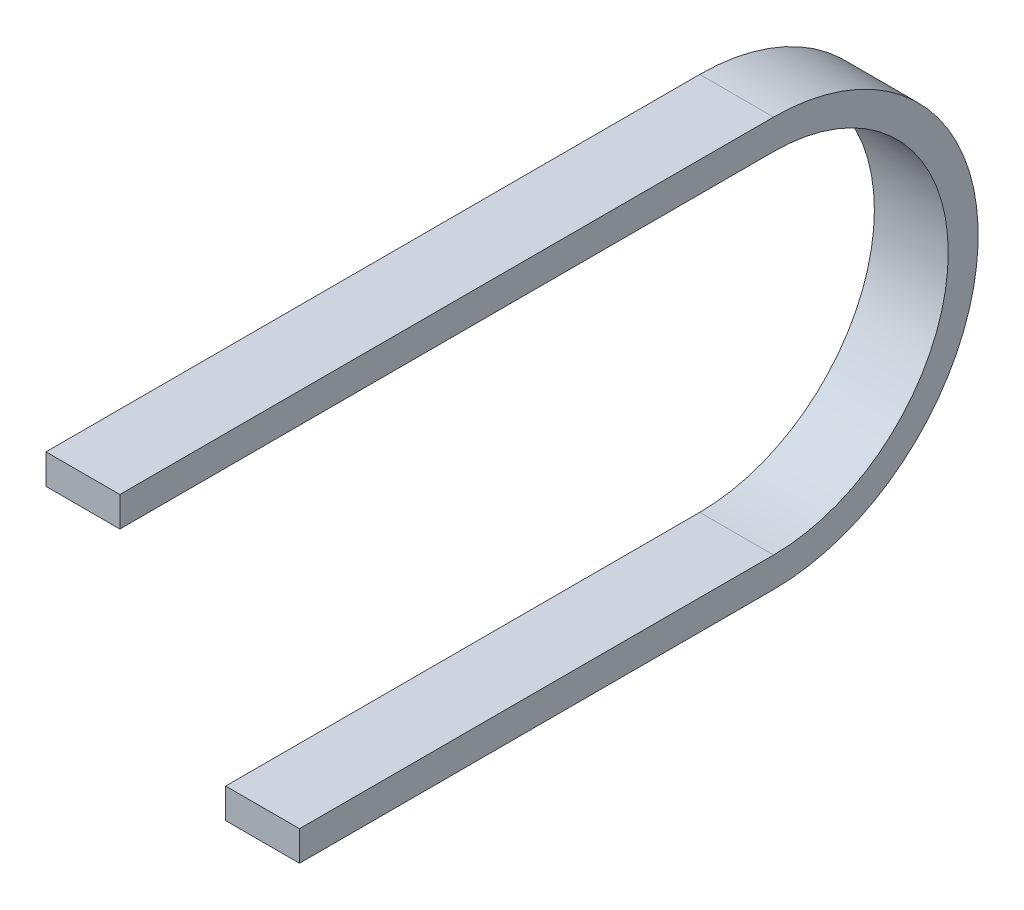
ISO-10303-21;
HEADER;
FILE_DESCRIPTION(('STEP AP214'),'2;1');
FILE_NAME('part.step','',(''),(''),'','','');
FILE_SCHEMA(('AUTOMOTIVE_DESIGN { 1 0 10303 214 1 1 1 1 }'));
ENDSEC;
DATA;
#1=APPLICATION_CONTEXT('core data for automotive mechanical design processes');
#2=APPLICATION_PROTOCOL_DEFINITION('international standard','automotive_design',2000,#1);
#3=PRODUCT_CONTEXT('',#1,'mechanical');
#4=PRODUCT('Part','Part','',(#3));
#5=PRODUCT_RELATED_PRODUCT_CATEGORY('part','',(#4));
#6=PRODUCT_DEFINITION_FORMATION('','',#4);
#7=PRODUCT_DEFINITION_CONTEXT('part definition',#1,'design');
#8=PRODUCT_DEFINITION('design','',#6,#7);
#9=PRODUCT_DEFINITION_SHAPE('','',#8);
#10=(LENGTH_UNIT() NAMED_UNIT(*) SI_UNIT(.MILLI.,.METRE.));
#11=(NAMED_UNIT(*) PLANE_ANGLE_UNIT() SI_UNIT($,.RADIAN.));
#12=(NAMED_UNIT(*) SI_UNIT($,.STERADIAN.) SOLID_ANGLE_UNIT());
#13=UNCERTAINTY_MEASURE_WITH_UNIT(LENGTH_MEASURE(1.E-05),#10,'distance_accuracy_value','');
#14=(GEOMETRIC_REPRESENTATION_CONTEXT(3) GLOBAL_UNCERTAINTY_ASSIGNED_CONTEXT((#13)) GLOBAL_UNIT_ASSIGNED_CONTEXT((#10,
#11,#12)) REPRESENTATION_CONTEXT('',''));
#15=CARTESIAN_POINT('',(0.,0.,0.));
#16=DIRECTION('',(0.,0.,1.));
#17=DIRECTION('',(1.,0.,0.));
#18=AXIS2_PLACEMENT_3D('',#15,#16,#17);
#19=CARTESIAN_POINT('',(-18.5,-197.5,-327.499999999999));
#20=DIRECTION('',(0.,1.,0.));
#21=DIRECTION('',(0.,0.,1.));
#22=AXIS2_PLACEMENT_3D('',#19,#20,#21);
#23=PLANE('',#22);
#24=DIRECTION('',(-1.,0.,0.));
#25=VECTOR('',#24,1.);
#26=CARTESIAN_POINT('',(-18.5,-197.5,-327.499999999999));
#27=LINE('',#26,#25);
#28=CARTESIAN_POINT('',(18.5,-197.5,-327.499999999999));
#29=VERTEX_POINT('',#28);
#30=CARTESIAN_POINT('',(-18.5,-197.5,-327.499999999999));
#31=VERTEX_POINT('',#30);
#32=EDGE_CURVE('E110',#29,#31,#27,.T.);
#33=ORIENTED_EDGE('',*,*,#32,.F.);
#34=DIRECTION('',(0.,0.,1.));
#35=VECTOR('',#34,1.);
#36=CARTESIAN_POINT('',(18.5,-197.5,-327.499999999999));
#37=LINE('',#36,#35);
#38=CARTESIAN_POINT('',(18.5,-197.5,-89.9999999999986));
#39=VERTEX_POINT('',#38);
#40=EDGE_CURVE('E40',#29,#39,#37,.T.);
#41=ORIENTED_EDGE('',*,*,#40,.T.);
#42=DIRECTION('',(-1.,0.,0.));
#43=VECTOR('',#42,1.);
#44=CARTESIAN_POINT('',(-18.5,-197.5,-89.9999999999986));
#45=LINE('',#44,#43);
#46=CARTESIAN_POINT('',(-18.5,-197.5,-89.9999999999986));
#47=VERTEX_POINT('',#46);
#48=EDGE_CURVE('E47',#39,#47,#45,.T.);
#49=ORIENTED_EDGE('',*,*,#48,.T.);
#50=DIRECTION('',(0.,0.,1.));
#51=VECTOR('',#50,1.);
#52=CARTESIAN_POINT('',(-18.5,-197.5,-327.499999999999));
#53=LINE('',#52,#51);
#54=EDGE_CURVE('E11',#31,#47,#53,.T.);
#55=ORIENTED_EDGE('',*,*,#54,.F.);
#56=EDGE_LOOP('',(#33,#41,#49,#55));
#57=FACE_BOUND('',#56,.T.);
#58=ADVANCED_FACE('F33',(#57),#23,.F.);
#59=CARTESIAN_POINT('',(-18.5,-182.5,-327.499999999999));
#60=DIRECTION('',(0.,-1.,0.));
#61=DIRECTION('',(0.,0.,-1.));
#62=AXIS2_PLACEMENT_3D('',#59,#60,#61);
#63=PLANE('',#62);
#64=DIRECTION('',(1.,0.,0.));
#65=VECTOR('',#64,1.);
#66=CARTESIAN_POINT('',(-18.5,-182.5,-327.499999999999));
#67=LINE('',#66,#65);
#68=CARTESIAN_POINT('',(-18.5,-182.5,-327.499999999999));
#69=VERTEX_POINT('',#68);
#70=CARTESIAN_POINT('',(18.5,-182.5,-327.499999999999));
#71=VERTEX_POINT('',#70);
#72=EDGE_CURVE('E133',#69,#71,#67,.T.);
#73=ORIENTED_EDGE('',*,*,#72,.F.);
#74=DIRECTION('',(0.,0.,1.));
#75=VECTOR('',#74,1.);
#76=CARTESIAN_POINT('',(-18.5,-182.5,-327.499999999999));
#77=LINE('',#76,#75);
#78=CARTESIAN_POINT('',(-18.5,-182.5,-89.9999999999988));
#79=VERTEX_POINT('',#78);
#80=EDGE_CURVE('E105',#69,#79,#77,.T.);
#81=ORIENTED_EDGE('',*,*,#80,.T.);
#82=DIRECTION('',(1.,0.,0.));
#83=VECTOR('',#82,1.);
#84=CARTESIAN_POINT('',(-18.5,-182.5,-89.9999999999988));
#85=LINE('',#84,#83);
#86=CARTESIAN_POINT('',(18.5,-182.5,-89.9999999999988));
#87=VERTEX_POINT('',#86);
#88=EDGE_CURVE('E147',#79,#87,#85,.T.);
#89=ORIENTED_EDGE('',*,*,#88,.T.);
#90=DIRECTION('',(0.,0.,1.));
#91=VECTOR('',#90,1.);
#92=CARTESIAN_POINT('',(18.5,-182.5,-327.499999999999));
#93=LINE('',#92,#91);
#94=EDGE_CURVE('E152',#71,#87,#93,.T.);
#95=ORIENTED_EDGE('',*,*,#94,.F.);
#96=EDGE_LOOP('',(#73,#81,#89,#95));
#97=FACE_BOUND('',#96,.T.);
#98=ADVANCED_FACE('F179',(#97),#63,.F.);
#99=CARTESIAN_POINT('',(0.,-95.,-327.5));
#100=DIRECTION('',(-1.,0.,0.));
#101=DIRECTION('',(0.,0.,1.));
#102=AXIS2_PLACEMENT_3D('',#99,#100,#101);
#103=CYLINDRICAL_SURFACE('',#102,102.5);
#104=DIRECTION('',(-1.,0.,0.));
#105=VECTOR('',#104,1.);
#106=CARTESIAN_POINT('',(-18.5,7.5,-327.5));
#107=LINE('',#106,#105);
#108=CARTESIAN_POINT('',(18.5,7.5,-327.5));
#109=VERTEX_POINT('',#108);
#110=CARTESIAN_POINT('',(-18.5,7.5,-327.5));
#111=VERTEX_POINT('',#110);
#112=EDGE_CURVE('E118',#109,#111,#107,.T.);
#113=ORIENTED_EDGE('',*,*,#112,.F.);
#114=CARTESIAN_POINT('',(18.5,-95.,-327.5));
#115=DIRECTION('',(-1.,0.,0.));
#116=DIRECTION('',(0.,0.,1.));
#117=AXIS2_PLACEMENT_3D('',#114,#115,#116);
#118=CIRCLE('',#117,102.5);
#119=EDGE_CURVE('E139',#109,#29,#118,.T.);
#120=ORIENTED_EDGE('',*,*,#119,.T.);
#121=ORIENTED_EDGE('',*,*,#32,.T.);
#122=CARTESIAN_POINT('',(-18.5,-95.,-327.5));
#123=DIRECTION('',(-1.,0.,0.));
#124=DIRECTION('',(0.,0.,1.));
#125=AXIS2_PLACEMENT_3D('',#122,#123,#124);
#126=CIRCLE('',#125,102.5);
#127=EDGE_CURVE('E142',#111,#31,#126,.T.);
#128=ORIENTED_EDGE('',*,*,#127,.F.);
#129=EDGE_LOOP('',(#113,#120,#121,#128));
#130=FACE_BOUND('',#129,.T.);
#131=ADVANCED_FACE('F160',(#130),#103,.T.);
#132=CARTESIAN_POINT('',(0.,-95.,-327.5));
#133=DIRECTION('',(-1.,0.,0.));
#134=DIRECTION('',(0.,0.,1.));
#135=AXIS2_PLACEMENT_3D('',#132,#133,#134);
#136=CYLINDRICAL_SURFACE('',#135,87.5);
#137=DIRECTION('',(1.,0.,0.));
#138=VECTOR('',#137,1.);
#139=CARTESIAN_POINT('',(-18.5,-7.5,-327.5));
#140=LINE('',#139,#138);
#141=CARTESIAN_POINT('',(-18.5,-7.5,-327.5));
#142=VERTEX_POINT('',#141);
#143=CARTESIAN_POINT('',(18.5,-7.5,-327.5));
#144=VERTEX_POINT('',#143);
#145=EDGE_CURVE('E113',#142,#144,#140,.T.);
#146=ORIENTED_EDGE('',*,*,#145,.F.);
#147=CARTESIAN_POINT('',(-18.5,-95.,-327.5));
#148=DIRECTION('',(-1.,0.,0.));
#149=DIRECTION('',(0.,0.,1.));
#150=AXIS2_PLACEMENT_3D('',#147,#148,#149);
#151=CIRCLE('',#150,87.5);
#152=EDGE_CURVE('E97',#142,#69,#151,.T.);
#153=ORIENTED_EDGE('',*,*,#152,.T.);
#154=ORIENTED_EDGE('',*,*,#72,.T.);
#155=CARTESIAN_POINT('',(18.5,-95.,-327.5));
#156=DIRECTION('',(-1.,0.,0.));
#157=DIRECTION('',(0.,0.,1.));
#158=AXIS2_PLACEMENT_3D('',#155,#156,#157);
#159=CIRCLE('',#158,87.5);
#160=EDGE_CURVE('E109',#144,#71,#159,.T.);
#161=ORIENTED_EDGE('',*,*,#160,.F.);
#162=EDGE_LOOP('',(#146,#153,#154,#161));
#163=FACE_BOUND('',#162,.T.);
#164=ADVANCED_FACE('F114',(#163),#136,.F.);
#165=CARTESIAN_POINT('',(-18.5,7.5,-327.5));
#166=DIRECTION('',(-1.,0.,0.));
#167=DIRECTION('',(0.,-1.,0.));
#168=AXIS2_PLACEMENT_3D('',#165,#166,#167);
#169=PLANE('',#168);
#170=DIRECTION('',(0.,-1.,0.));
#171=VECTOR('',#170,1.);
#172=CARTESIAN_POINT('',(-18.5,7.5,0.));
#173=LINE('',#172,#171);
#174=CARTESIAN_POINT('',(-18.5,7.5,0.));
#175=VERTEX_POINT('',#174);
#176=CARTESIAN_POINT('',(-18.5,-7.5,0.));
#177=VERTEX_POINT('',#176);
#178=EDGE_CURVE('E172',#175,#177,#173,.T.);
#179=ORIENTED_EDGE('',*,*,#178,.F.);
#180=DIRECTION('',(0.,0.,1.));
#181=VECTOR('',#180,1.);
#182=CARTESIAN_POINT('',(-18.5,7.5,-327.5));
#183=LINE('',#182,#181);
#184=EDGE_CURVE('E135',#111,#175,#183,.T.);
#185=ORIENTED_EDGE('',*,*,#184,.F.);
#186=ORIENTED_EDGE('',*,*,#127,.T.);
#187=ORIENTED_EDGE('',*,*,#54,.T.);
#188=DIRECTION('',(0.,1.,0.));
#189=VECTOR('',#188,1.);
#190=CARTESIAN_POINT('',(-18.5,-197.5,-89.9999999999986));
#191=LINE('',#190,#189);
#192=EDGE_CURVE('E145',#47,#79,#191,.T.);
#193=ORIENTED_EDGE('',*,*,#192,.T.);
#194=ORIENTED_EDGE('',*,*,#80,.F.);
#195=ORIENTED_EDGE('',*,*,#152,.F.);
#196=DIRECTION('',(0.,0.,1.));
#197=VECTOR('',#196,1.);
#198=CARTESIAN_POINT('',(-18.5,-7.5,-327.5));
#199=LINE('',#198,#197);
#200=EDGE_CURVE('E102',#142,#177,#199,.T.);
#201=ORIENTED_EDGE('',*,*,#200,.T.);
#202=EDGE_LOOP('',(#179,#185,#186,#187,#193,#194,#195,#201));
#203=FACE_BOUND('',#202,.T.);
#204=ADVANCED_FACE('F100',(#203),#169,.T.);
#205=CARTESIAN_POINT('',(-18.5,7.5,-327.5));
#206=DIRECTION('',(0.,1.,0.));
#207=DIRECTION('',(0.,0.,1.));
#208=AXIS2_PLACEMENT_3D('',#205,#206,#207);
#209=PLANE('',#208);
#210=DIRECTION('',(-1.,0.,0.));
#211=VECTOR('',#210,1.);
#212=CARTESIAN_POINT('',(-18.5,7.5,0.));
#213=LINE('',#212,#211);
#214=CARTESIAN_POINT('',(18.5,7.5,0.));
#215=VERTEX_POINT('',#214);
#216=EDGE_CURVE('E119',#215,#175,#213,.T.);
#217=ORIENTED_EDGE('',*,*,#216,.F.);
#218=DIRECTION('',(0.,0.,1.));
#219=VECTOR('',#218,1.);
#220=CARTESIAN_POINT('',(18.5,7.5,-327.5));
#221=LINE('',#220,#219);
#222=EDGE_CURVE('E127',#109,#215,#221,.T.);
#223=ORIENTED_EDGE('',*,*,#222,.F.);
#224=ORIENTED_EDGE('',*,*,#112,.T.);
#225=ORIENTED_EDGE('',*,*,#184,.T.);
#226=EDGE_LOOP('',(#217,#223,#224,#225));
#227=FACE_BOUND('',#226,.T.);
#228=ADVANCED_FACE('F164',(#227),#209,.T.);
#229=CARTESIAN_POINT('',(18.5,7.5,-327.5));
#230=DIRECTION('',(1.,0.,0.));
#231=DIRECTION('',(0.,1.,0.));
#232=AXIS2_PLACEMENT_3D('',#229,#230,#231);
#233=PLANE('',#232);
#234=DIRECTION('',(0.,1.,0.));
#235=VECTOR('',#234,1.);
#236=CARTESIAN_POINT('',(18.5,7.5,0.));
#237=LINE('',#236,#235);
#238=CARTESIAN_POINT('',(18.5,-7.5,0.));
#239=VERTEX_POINT('',#238);
#240=EDGE_CURVE('E169',#239,#215,#237,.T.);
#241=ORIENTED_EDGE('',*,*,#240,.F.);
#242=DIRECTION('',(0.,0.,1.));
#243=VECTOR('',#242,1.);
#244=CARTESIAN_POINT('',(18.5,-7.5,-327.5));
#245=LINE('',#244,#243);
#246=EDGE_CURVE('E125',#144,#239,#245,.T.);
#247=ORIENTED_EDGE('',*,*,#246,.F.);
#248=ORIENTED_EDGE('',*,*,#160,.T.);
#249=ORIENTED_EDGE('',*,*,#94,.T.);
#250=DIRECTION('',(0.,-1.,0.));
#251=VECTOR('',#250,1.);
#252=CARTESIAN_POINT('',(18.5,-197.5,-89.9999999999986));
#253=LINE('',#252,#251);
#254=EDGE_CURVE('E55',#87,#39,#253,.T.);
#255=ORIENTED_EDGE('',*,*,#254,.T.);
#256=ORIENTED_EDGE('',*,*,#40,.F.);
#257=ORIENTED_EDGE('',*,*,#119,.F.);
#258=ORIENTED_EDGE('',*,*,#222,.T.);
#259=EDGE_LOOP('',(#241,#247,#248,#249,#255,#256,#257,#258));
#260=FACE_BOUND('',#259,.T.);
#261=ADVANCED_FACE('F155',(#260),#233,.T.);
#262=CARTESIAN_POINT('',(-18.5,-7.5,-327.5));
#263=DIRECTION('',(0.,-1.,0.));
#264=DIRECTION('',(1.,0.,0.));
#265=AXIS2_PLACEMENT_3D('',#262,#263,#264);
#266=PLANE('',#265);
#267=DIRECTION('',(1.,0.,0.));
#268=VECTOR('',#267,1.);
#269=CARTESIAN_POINT('',(-18.5,-7.5,0.));
#270=LINE('',#269,#268);
#271=EDGE_CURVE('E123',#177,#239,#270,.T.);
#272=ORIENTED_EDGE('',*,*,#271,.F.);
#273=ORIENTED_EDGE('',*,*,#200,.F.);
#274=ORIENTED_EDGE('',*,*,#145,.T.);
#275=ORIENTED_EDGE('',*,*,#246,.T.);
#276=EDGE_LOOP('',(#272,#273,#274,#275));
#277=FACE_BOUND('',#276,.T.);
#278=ADVANCED_FACE('F121',(#277),#266,.T.);
#279=CARTESIAN_POINT('',(-18.5,-182.5,-89.9999999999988));
#280=DIRECTION('',(0.,0.,-1.));
#281=DIRECTION('',(1.,0.,0.));
#282=AXIS2_PLACEMENT_3D('',#279,#280,#281);
#283=PLANE('',#282);
#284=ORIENTED_EDGE('',*,*,#192,.F.);
#285=ORIENTED_EDGE('',*,*,#48,.F.);
#286=ORIENTED_EDGE('',*,*,#254,.F.);
#287=ORIENTED_EDGE('',*,*,#88,.F.);
#288=EDGE_LOOP('',(#284,#285,#286,#287));
#289=FACE_BOUND('',#288,.T.);
#290=ADVANCED_FACE('F177',(#289),#283,.F.);
#291=CARTESIAN_POINT('',(-18.5,-7.5,0.));
#292=DIRECTION('',(0.,0.,1.));
#293=DIRECTION('',(1.,0.,0.));
#294=AXIS2_PLACEMENT_3D('',#291,#292,#293);
#295=PLANE('',#294);
#296=ORIENTED_EDGE('',*,*,#178,.T.);
#297=ORIENTED_EDGE('',*,*,#271,.T.);
#298=ORIENTED_EDGE('',*,*,#240,.T.);
#299=ORIENTED_EDGE('',*,*,#216,.T.);
#300=EDGE_LOOP('',(#296,#297,#298,#299));
#301=FACE_BOUND('',#300,.T.);
#302=ADVANCED_FACE('F174',(#301),#295,.T.);
#303=CLOSED_SHELL('',(#58,#98,#131,#164,#204,#228,#261,#278,#290,#302));
#304=MANIFOLD_SOLID_BREP('B2',#303);
#305=ADVANCED_BREP_SHAPE_REPRESENTATION('',(#18,#304),#14);
#306=SHAPE_DEFINITION_REPRESENTATION(#9,#305);
ENDSEC;
END-ISO-10303-21;
